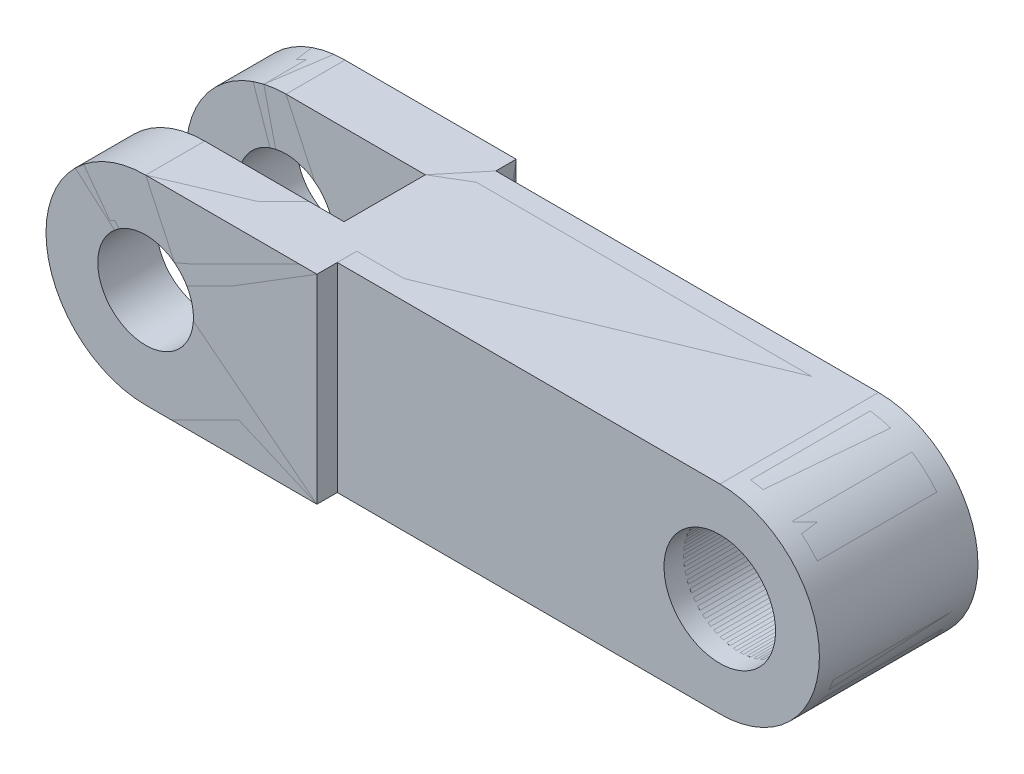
ISO-10303-21;
HEADER;
FILE_DESCRIPTION(('STEP AP214'),'2;1');
FILE_NAME('part.step','',(''),(''),'','','');
FILE_SCHEMA(('AUTOMOTIVE_DESIGN { 1 0 10303 214 1 1 1 1 }'));
ENDSEC;
DATA;
#1=APPLICATION_CONTEXT('core data for automotive mechanical design processes');
#2=APPLICATION_PROTOCOL_DEFINITION('international standard','automotive_design',2000,#1);
#3=PRODUCT_CONTEXT('',#1,'mechanical');
#4=PRODUCT('Part','Part','',(#3));
#5=PRODUCT_RELATED_PRODUCT_CATEGORY('part','',(#4));
#6=PRODUCT_DEFINITION_FORMATION('','',#4);
#7=PRODUCT_DEFINITION_CONTEXT('part definition',#1,'design');
#8=PRODUCT_DEFINITION('design','',#6,#7);
#9=PRODUCT_DEFINITION_SHAPE('','',#8);
#10=(LENGTH_UNIT() NAMED_UNIT(*) SI_UNIT(.MILLI.,.METRE.));
#11=(NAMED_UNIT(*) PLANE_ANGLE_UNIT() SI_UNIT($,.RADIAN.));
#12=(NAMED_UNIT(*) SI_UNIT($,.STERADIAN.) SOLID_ANGLE_UNIT());
#13=UNCERTAINTY_MEASURE_WITH_UNIT(LENGTH_MEASURE(1.E-05),#10,'distance_accuracy_value','');
#14=(GEOMETRIC_REPRESENTATION_CONTEXT(3) GLOBAL_UNCERTAINTY_ASSIGNED_CONTEXT((#13)) GLOBAL_UNIT_ASSIGNED_CONTEXT((#10,
#11,#12)) REPRESENTATION_CONTEXT('',''));
#15=CARTESIAN_POINT('',(0.,0.,0.));
#16=DIRECTION('',(0.,0.,1.));
#17=DIRECTION('',(1.,0.,0.));
#18=AXIS2_PLACEMENT_3D('',#15,#16,#17);
#19=CARTESIAN_POINT('',(-5.5,-0.094581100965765,-2.55));
#20=DIRECTION('',(0.,0.,-1.));
#21=DIRECTION('',(0.,1.,0.));
#22=AXIS2_PLACEMENT_3D('',#19,#20,#21);
#23=CYLINDRICAL_SURFACE('',#22,7.);
#24=CARTESIAN_POINT('',(-5.5,-0.0945811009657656,-20.));
#25=DIRECTION('',(0.,0.,1.));
#26=DIRECTION('',(1.,0.,0.));
#27=AXIS2_PLACEMENT_3D('',#24,#25,#26);
#28=CIRCLE('',#27,7.);
#29=CARTESIAN_POINT('',(1.5,-0.0945811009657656,-20.));
#30=VERTEX_POINT('',#29);
#31=EDGE_CURVE('P0_E468',#30,#30,#28,.T.);
#32=ORIENTED_EDGE('',*,*,#31,.F.);
#33=EDGE_LOOP('',(#32));
#34=FACE_BOUND('',#33,.T.);
#35=CARTESIAN_POINT('',(-5.5,-0.0945811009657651,-5.));
#36=DIRECTION('',(0.,0.,1.));
#37=DIRECTION('',(1.,0.,0.));
#38=AXIS2_PLACEMENT_3D('',#35,#36,#37);
#39=CIRCLE('',#38,7.);
#40=CARTESIAN_POINT('',(1.5,-0.0945811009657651,-5.));
#41=VERTEX_POINT('',#40);
#42=EDGE_CURVE('P0_E479',#41,#41,#39,.T.);
#43=ORIENTED_EDGE('',*,*,#42,.T.);
#44=EDGE_LOOP('',(#43));
#45=FACE_BOUND('',#44,.T.);
#46=ADVANCED_FACE('P0_F348',(#34,#45),#23,.F.);
#47=CARTESIAN_POINT('',(-5.5,-0.094581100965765,-22.45));
#48=DIRECTION('',(0.,0.,1.));
#49=DIRECTION('',(0.,-1.,0.));
#50=AXIS2_PLACEMENT_3D('',#47,#48,#49);
#51=CYLINDRICAL_SURFACE('',#50,12.5000000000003);
#52=DIRECTION('',(0.,0.,1.));
#53=VECTOR('',#52,1.);
#54=CARTESIAN_POINT('',(-5.5170109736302,-12.594569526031,-34.750032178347));
#55=LINE('',#54,#53);
#56=CARTESIAN_POINT('',(-5.5170109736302,-12.594569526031,-20.));
#57=VERTEX_POINT('',#56);
#58=CARTESIAN_POINT('',(-5.51701097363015,-12.594569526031,-5.));
#59=VERTEX_POINT('',#58);
#60=EDGE_CURVE('P0_E454',#57,#59,#55,.T.);
#61=ORIENTED_EDGE('',*,*,#60,.F.);
#62=CARTESIAN_POINT('',(-5.5,-0.0945811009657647,-20.));
#63=DIRECTION('',(0.,0.,1.));
#64=DIRECTION('',(1.,0.,0.));
#65=AXIS2_PLACEMENT_3D('',#62,#63,#64);
#66=CIRCLE('',#65,12.5000000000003);
#67=CARTESIAN_POINT('',(-5.48298902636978,12.4054073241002,-20.));
#68=VERTEX_POINT('',#67);
#69=EDGE_CURVE('P0_E362',#57,#68,#66,.T.);
#70=ORIENTED_EDGE('',*,*,#69,.T.);
#71=DIRECTION('',(0.,0.,-1.));
#72=VECTOR('',#71,1.);
#73=CARTESIAN_POINT('',(-5.4829890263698,12.4054073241,-34.750032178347));
#74=LINE('',#73,#72);
#75=CARTESIAN_POINT('',(-5.48298902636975,12.4054073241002,-5.));
#76=VERTEX_POINT('',#75);
#77=EDGE_CURVE('P0_E535',#76,#68,#74,.T.);
#78=ORIENTED_EDGE('',*,*,#77,.F.);
#79=CARTESIAN_POINT('',(-5.5,-0.0945811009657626,-5.));
#80=DIRECTION('',(0.,0.,1.));
#81=DIRECTION('',(1.,0.,0.));
#82=AXIS2_PLACEMENT_3D('',#79,#80,#81);
#83=CIRCLE('',#82,12.5000000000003);
#84=EDGE_CURVE('P0_E474',#59,#76,#83,.T.);
#85=ORIENTED_EDGE('',*,*,#84,.F.);
#86=EDGE_LOOP('',(#61,#70,#78,#85));
#87=FACE_BOUND('',#86,.T.);
#88=ADVANCED_FACE('P0_F593',(#87),#51,.T.);
#89=CARTESIAN_POINT('',(-75.,0.,-17.6));
#90=DIRECTION('',(0.,0.,-1.));
#91=DIRECTION('',(-1.,0.,0.));
#92=AXIS2_PLACEMENT_3D('',#89,#90,#91);
#93=CYLINDRICAL_SURFACE('',#92,5.99999999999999);
#94=CARTESIAN_POINT('',(-75.,0.,-17.6));
#95=DIRECTION('',(0.,0.,-1.));
#96=DIRECTION('',(-1.,0.,0.));
#97=AXIS2_PLACEMENT_3D('',#94,#95,#96);
#98=CIRCLE('',#97,5.99999999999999);
#99=CARTESIAN_POINT('',(-81.,0.,-17.6));
#100=VERTEX_POINT('',#99);
#101=EDGE_CURVE('P0_E523',#100,#100,#98,.F.);
#102=ORIENTED_EDGE('',*,*,#101,.T.);
#103=EDGE_LOOP('',(#102));
#104=FACE_BOUND('',#103,.T.);
#105=CARTESIAN_POINT('',(-75.,0.,-25.));
#106=DIRECTION('',(0.,0.,-1.));
#107=DIRECTION('',(-1.,0.,0.));
#108=AXIS2_PLACEMENT_3D('',#105,#106,#107);
#109=CIRCLE('',#108,5.99999999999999);
#110=CARTESIAN_POINT('',(-81.,0.,-25.));
#111=VERTEX_POINT('',#110);
#112=EDGE_CURVE('P0_E508',#111,#111,#109,.F.);
#113=ORIENTED_EDGE('',*,*,#112,.F.);
#114=EDGE_LOOP('',(#113));
#115=FACE_BOUND('',#114,.T.);
#116=ADVANCED_FACE('P0_F634',(#104,#115),#93,.F.);
#117=CARTESIAN_POINT('',(-57.5,12.47619618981,-17.6));
#118=DIRECTION('',(1.,0.,0.));
#119=DIRECTION('',(0.,0.,1.));
#120=AXIS2_PLACEMENT_3D('',#117,#118,#119);
#121=PLANE('',#120);
#122=DIRECTION('',(0.,1.,0.));
#123=VECTOR('',#122,1.);
#124=CARTESIAN_POINT('',(-57.5,2.47617303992,-7.4));
#125=LINE('',#124,#123);
#126=CARTESIAN_POINT('',(-57.4999999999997,-12.5238269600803,-7.39999999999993));
#127=VERTEX_POINT('',#126);
#128=CARTESIAN_POINT('',(-57.5000000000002,12.4761961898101,-7.39999999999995));
#129=VERTEX_POINT('',#128);
#130=EDGE_CURVE('P0_E507',#127,#129,#125,.T.);
#131=ORIENTED_EDGE('',*,*,#130,.T.);
#132=DIRECTION('',(0.,0.,1.));
#133=VECTOR('',#132,1.);
#134=CARTESIAN_POINT('',(-57.5000000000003,12.47619618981,-34.750032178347));
#135=LINE('',#134,#133);
#136=CARTESIAN_POINT('',(-57.5000000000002,12.4761961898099,-17.5999999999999));
#137=VERTEX_POINT('',#136);
#138=EDGE_CURVE('P0_E541',#137,#129,#135,.T.);
#139=ORIENTED_EDGE('',*,*,#138,.F.);
#140=DIRECTION('',(0.,-1.,0.));
#141=VECTOR('',#140,1.);
#142=CARTESIAN_POINT('',(-57.5,-2.35,-17.6));
#143=LINE('',#142,#141);
#144=CARTESIAN_POINT('',(-57.4999999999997,-12.5238269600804,-17.5999999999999));
#145=VERTEX_POINT('',#144);
#146=EDGE_CURVE('P0_E416',#137,#145,#143,.T.);
#147=ORIENTED_EDGE('',*,*,#146,.T.);
#148=DIRECTION('',(0.,0.,-1.));
#149=VECTOR('',#148,1.);
#150=CARTESIAN_POINT('',(-57.4999999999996,-12.5238269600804,-34.750032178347));
#151=LINE('',#150,#149);
#152=EDGE_CURVE('P0_E519',#127,#145,#151,.T.);
#153=ORIENTED_EDGE('',*,*,#152,.F.);
#154=EDGE_LOOP('',(#131,#139,#147,#153));
#155=FACE_BOUND('',#154,.T.);
#156=ADVANCED_FACE('P0_F608',(#155),#121,.F.);
#157=CARTESIAN_POINT('',(-87.8,12.8,-17.6));
#158=DIRECTION('',(0.,0.,-1.));
#159=DIRECTION('',(1.,0.,0.));
#160=AXIS2_PLACEMENT_3D('',#157,#158,#159);
#161=PLANE('',#160);
#162=ORIENTED_EDGE('',*,*,#101,.F.);
#163=EDGE_LOOP('',(#162));
#164=FACE_BOUND('',#163,.T.);
#165=CARTESIAN_POINT('',(-75.,0.,-17.6));
#166=DIRECTION('',(0.,0.,1.));
#167=DIRECTION('',(1.,0.,0.));
#168=AXIS2_PLACEMENT_3D('',#165,#166,#167);
#169=CIRCLE('',#168,12.5000000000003);
#170=CARTESIAN_POINT('',(-74.9829890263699,12.499988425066,-17.5999999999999));
#171=VERTEX_POINT('',#170);
#172=CARTESIAN_POINT('',(-75.0170109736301,-12.499988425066,-17.5999999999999));
#173=VERTEX_POINT('',#172);
#174=EDGE_CURVE('P0_E409',#171,#173,#169,.T.);
#175=ORIENTED_EDGE('',*,*,#174,.T.);
#176=DIRECTION('',(-0.999999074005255,0.00136087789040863,0.));
#177=VECTOR('',#176,1.);
#178=CARTESIAN_POINT('',(-40.2670109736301,-12.5472789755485,-17.5999999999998));
#179=LINE('',#178,#177);
#180=EDGE_CURVE('P0_E516',#145,#173,#179,.T.);
#181=ORIENTED_EDGE('',*,*,#180,.F.);
#182=ORIENTED_EDGE('',*,*,#146,.F.);
#183=DIRECTION('',(0.999999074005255,-0.00136087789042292,0.));
#184=VECTOR('',#183,1.);
#185=CARTESIAN_POINT('',(-40.2329890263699,12.452697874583,-17.5999999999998));
#186=LINE('',#185,#184);
#187=EDGE_CURVE('P0_E546',#171,#137,#186,.T.);
#188=ORIENTED_EDGE('',*,*,#187,.F.);
#189=EDGE_LOOP('',(#175,#181,#182,#188));
#190=FACE_BOUND('',#189,.T.);
#191=ADVANCED_FACE('P0_F609',(#164,#190),#161,.F.);
#192=CARTESIAN_POINT('',(-75.,0.,-25.));
#193=DIRECTION('',(0.,0.,1.));
#194=DIRECTION('',(1.,0.,0.));
#195=AXIS2_PLACEMENT_3D('',#192,#193,#194);
#196=CYLINDRICAL_SURFACE('',#195,12.5000000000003);
#197=ORIENTED_EDGE('',*,*,#174,.F.);
#198=DIRECTION('',(0.,0.,1.));
#199=VECTOR('',#198,1.);
#200=CARTESIAN_POINT('',(-74.98298902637,12.499988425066,-34.750032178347));
#201=LINE('',#200,#199);
#202=CARTESIAN_POINT('',(-74.9829890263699,12.499988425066,-24.9999999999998));
#203=VERTEX_POINT('',#202);
#204=EDGE_CURVE('P0_E551',#203,#171,#201,.T.);
#205=ORIENTED_EDGE('',*,*,#204,.F.);
#206=CARTESIAN_POINT('',(-75.,0.,-25.));
#207=DIRECTION('',(0.,0.,1.));
#208=DIRECTION('',(1.,0.,0.));
#209=AXIS2_PLACEMENT_3D('',#206,#207,#208);
#210=CIRCLE('',#209,12.5000000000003);
#211=CARTESIAN_POINT('',(-75.0170109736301,-12.499988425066,-24.9999999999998));
#212=VERTEX_POINT('',#211);
#213=EDGE_CURVE('P0_E581',#212,#203,#210,.F.);
#214=ORIENTED_EDGE('',*,*,#213,.F.);
#215=DIRECTION('',(0.,0.,-1.));
#216=VECTOR('',#215,1.);
#217=CARTESIAN_POINT('',(-75.01701097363,-12.499988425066,-34.750032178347));
#218=LINE('',#217,#216);
#219=EDGE_CURVE('P0_E512',#173,#212,#218,.T.);
#220=ORIENTED_EDGE('',*,*,#219,.F.);
#221=EDGE_LOOP('',(#197,#205,#214,#220));
#222=FACE_BOUND('',#221,.T.);
#223=ADVANCED_FACE('P0_F613',(#222),#196,.T.);
#224=CARTESIAN_POINT('',(-87.84,12.84,-25.));
#225=DIRECTION('',(0.,0.,-1.));
#226=DIRECTION('',(1.,0.,0.));
#227=AXIS2_PLACEMENT_3D('',#224,#225,#226);
#228=PLANE('',#227);
#229=ORIENTED_EDGE('',*,*,#112,.T.);
#230=EDGE_LOOP('',(#229));
#231=FACE_BOUND('',#230,.T.);
#232=ORIENTED_EDGE('',*,*,#213,.T.);
#233=DIRECTION('',(-0.999999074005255,0.00136087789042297,0.));
#234=VECTOR('',#233,1.);
#235=CARTESIAN_POINT('',(-40.2329890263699,12.452697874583,-24.9999999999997));
#236=LINE('',#235,#234);
#237=CARTESIAN_POINT('',(-53.5000000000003,12.4707526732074,-24.9999999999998));
#238=VERTEX_POINT('',#237);
#239=EDGE_CURVE('P0_E556',#238,#203,#236,.T.);
#240=ORIENTED_EDGE('',*,*,#239,.F.);
#241=DIRECTION('',(0.,-1.,0.));
#242=VECTOR('',#241,1.);
#243=CARTESIAN_POINT('',(-53.5,-0.0292589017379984,-25.));
#244=LINE('',#243,#242);
#245=CARTESIAN_POINT('',(-53.4999999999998,-12.5292704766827,-24.9999999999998));
#246=VERTEX_POINT('',#245);
#247=EDGE_CURVE('P0_E505',#238,#246,#244,.T.);
#248=ORIENTED_EDGE('',*,*,#247,.T.);
#249=DIRECTION('',(0.999999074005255,-0.0013608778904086,0.));
#250=VECTOR('',#249,1.);
#251=CARTESIAN_POINT('',(-40.2670109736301,-12.5472789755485,-24.9999999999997));
#252=LINE('',#251,#250);
#253=EDGE_CURVE('P0_E451',#212,#246,#252,.T.);
#254=ORIENTED_EDGE('',*,*,#253,.F.);
#255=EDGE_LOOP('',(#232,#240,#248,#254));
#256=FACE_BOUND('',#255,.T.);
#257=ADVANCED_FACE('P0_F615',(#231,#256),#228,.T.);
#258=CARTESIAN_POINT('',(-53.5,-12.529270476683,-25.));
#259=DIRECTION('',(-1.,0.,0.));
#260=DIRECTION('',(0.,0.,1.));
#261=AXIS2_PLACEMENT_3D('',#258,#259,#260);
#262=PLANE('',#261);
#263=ORIENTED_EDGE('',*,*,#247,.F.);
#264=DIRECTION('',(0.,0.,-1.));
#265=VECTOR('',#264,1.);
#266=CARTESIAN_POINT('',(-53.5000000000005,12.4707526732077,-34.750032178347));
#267=LINE('',#266,#265);
#268=CARTESIAN_POINT('',(-53.5000000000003,12.4707526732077,-20.));
#269=VERTEX_POINT('',#268);
#270=EDGE_CURVE('P0_E462',#269,#238,#267,.T.);
#271=ORIENTED_EDGE('',*,*,#270,.F.);
#272=DIRECTION('',(0.,1.,0.));
#273=VECTOR('',#272,1.);
#274=CARTESIAN_POINT('',(-53.5000000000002,34.620109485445,-20.));
#275=LINE('',#274,#273);
#276=CARTESIAN_POINT('',(-53.5000000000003,-12.5292704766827,-20.));
#277=VERTEX_POINT('',#276);
#278=EDGE_CURVE('P0_E458',#277,#269,#275,.T.);
#279=ORIENTED_EDGE('',*,*,#278,.F.);
#280=DIRECTION('',(0.,0.,1.));
#281=VECTOR('',#280,1.);
#282=CARTESIAN_POINT('',(-53.4999999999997,-12.5292704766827,-34.750032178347));
#283=LINE('',#282,#281);
#284=EDGE_CURVE('P0_E446',#246,#277,#283,.T.);
#285=ORIENTED_EDGE('',*,*,#284,.F.);
#286=EDGE_LOOP('',(#263,#271,#279,#285));
#287=FACE_BOUND('',#286,.T.);
#288=ADVANCED_FACE('P0_F460',(#287),#262,.F.);
#289=CARTESIAN_POINT('',(-87.8,-12.52382696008,-7.4));
#290=DIRECTION('',(0.,0.,1.));
#291=DIRECTION('',(1.,0.,0.));
#292=AXIS2_PLACEMENT_3D('',#289,#290,#291);
#293=PLANE('',#292);
#294=CARTESIAN_POINT('',(-75.,0.,-7.4));
#295=DIRECTION('',(0.,0.,-1.));
#296=DIRECTION('',(-1.,0.,0.));
#297=AXIS2_PLACEMENT_3D('',#294,#295,#296);
#298=CIRCLE('',#297,5.99999999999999);
#299=CARTESIAN_POINT('',(-81.,0.,-7.4));
#300=VERTEX_POINT('',#299);
#301=EDGE_CURVE('P0_E499',#300,#300,#298,.T.);
#302=ORIENTED_EDGE('',*,*,#301,.F.);
#303=EDGE_LOOP('',(#302));
#304=FACE_BOUND('',#303,.T.);
#305=DIRECTION('',(0.999999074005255,-0.0013608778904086,0.));
#306=VECTOR('',#305,1.);
#307=CARTESIAN_POINT('',(-40.2670109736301,-12.5472789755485,-7.39999999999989));
#308=LINE('',#307,#306);
#309=CARTESIAN_POINT('',(-75.0170109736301,-12.499988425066,-7.39999999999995));
#310=VERTEX_POINT('',#309);
#311=EDGE_CURVE('P0_E485',#310,#127,#308,.T.);
#312=ORIENTED_EDGE('',*,*,#311,.F.);
#313=CARTESIAN_POINT('',(-75.,0.,-7.4));
#314=DIRECTION('',(0.,0.,1.));
#315=DIRECTION('',(0.,-1.,0.));
#316=AXIS2_PLACEMENT_3D('',#313,#314,#315);
#317=CIRCLE('',#316,12.5000000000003);
#318=CARTESIAN_POINT('',(-74.9829890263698,12.499988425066,-7.39999999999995));
#319=VERTEX_POINT('',#318);
#320=EDGE_CURVE('P0_E497',#310,#319,#317,.F.);
#321=ORIENTED_EDGE('',*,*,#320,.T.);
#322=DIRECTION('',(-0.999999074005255,0.00136087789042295,0.));
#323=VECTOR('',#322,1.);
#324=CARTESIAN_POINT('',(-40.2329890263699,12.452697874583,-7.39999999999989));
#325=LINE('',#324,#323);
#326=EDGE_CURVE('P0_E538',#129,#319,#325,.T.);
#327=ORIENTED_EDGE('',*,*,#326,.F.);
#328=ORIENTED_EDGE('',*,*,#130,.F.);
#329=EDGE_LOOP('',(#312,#321,#327,#328));
#330=FACE_BOUND('',#329,.T.);
#331=ADVANCED_FACE('P0_F607',(#304,#330),#293,.F.);
#332=CARTESIAN_POINT('',(-5.4829890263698,12.4054073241,0.));
#333=DIRECTION('',(0.00136087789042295,0.999999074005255,0.));
#334=DIRECTION('',(0.,0.,-1.));
#335=AXIS2_PLACEMENT_3D('',#332,#333,#334);
#336=PLANE('',#335);
#337=DIRECTION('',(0.999999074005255,-0.00136087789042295,0.));
#338=VECTOR('',#337,1.);
#339=CARTESIAN_POINT('',(-5.4829890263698,12.4054073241,-20.));
#340=LINE('',#339,#338);
#341=EDGE_CURVE('P0_E464',#269,#68,#340,.T.);
#342=ORIENTED_EDGE('',*,*,#341,.F.);
#343=ORIENTED_EDGE('',*,*,#270,.T.);
#344=ORIENTED_EDGE('',*,*,#239,.T.);
#345=ORIENTED_EDGE('',*,*,#204,.T.);
#346=ORIENTED_EDGE('',*,*,#187,.T.);
#347=ORIENTED_EDGE('',*,*,#138,.T.);
#348=ORIENTED_EDGE('',*,*,#326,.T.);
#349=DIRECTION('',(0.,0.,1.));
#350=VECTOR('',#349,1.);
#351=CARTESIAN_POINT('',(-74.9829890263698,12.499988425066,-3.7));
#352=LINE('',#351,#350);
#353=CARTESIAN_POINT('',(-74.9829890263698,12.4999884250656,0.));
#354=VERTEX_POINT('',#353);
#355=EDGE_CURVE('P0_E486',#319,#354,#352,.T.);
#356=ORIENTED_EDGE('',*,*,#355,.T.);
#357=DIRECTION('',(-0.999999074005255,0.00136087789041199,0.));
#358=VECTOR('',#357,1.);
#359=CARTESIAN_POINT('',(-53.5,12.4707526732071,0.));
#360=LINE('',#359,#358);
#361=CARTESIAN_POINT('',(-53.5,12.4707526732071,0.));
#362=VERTEX_POINT('',#361);
#363=EDGE_CURVE('P0_E573',#362,#354,#360,.T.);
#364=ORIENTED_EDGE('',*,*,#363,.F.);
#365=DIRECTION('',(0.,0.,-1.));
#366=VECTOR('',#365,1.);
#367=CARTESIAN_POINT('',(-53.5,12.470752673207,-12.500011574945));
#368=LINE('',#367,#366);
#369=CARTESIAN_POINT('',(-53.5,12.4707526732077,-5.));
#370=VERTEX_POINT('',#369);
#371=EDGE_CURVE('P0_E493',#362,#370,#368,.T.);
#372=ORIENTED_EDGE('',*,*,#371,.T.);
#373=DIRECTION('',(0.999999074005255,-0.00136087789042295,0.));
#374=VECTOR('',#373,1.);
#375=CARTESIAN_POINT('',(-5.4829890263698,12.4054073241,-5.));
#376=LINE('',#375,#374);
#377=EDGE_CURVE('P0_E476',#370,#76,#376,.T.);
#378=ORIENTED_EDGE('',*,*,#377,.T.);
#379=ORIENTED_EDGE('',*,*,#77,.T.);
#380=EDGE_LOOP('',(#342,#343,#344,#345,#346,#347,#348,#356,#364,#372,#378,#379));
#381=FACE_BOUND('',#380,.T.);
#382=ADVANCED_FACE('P0_F595',(#381),#336,.T.);
#383=CARTESIAN_POINT('',(-75.,0.,-7.4));
#384=DIRECTION('',(0.,0.,1.));
#385=DIRECTION('',(0.,-1.,0.));
#386=AXIS2_PLACEMENT_3D('',#383,#384,#385);
#387=CYLINDRICAL_SURFACE('',#386,12.5000000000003);
#388=ORIENTED_EDGE('',*,*,#355,.F.);
#389=ORIENTED_EDGE('',*,*,#320,.F.);
#390=DIRECTION('',(0.,0.,-1.));
#391=VECTOR('',#390,1.);
#392=CARTESIAN_POINT('',(-75.01701097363,-12.499988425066,-34.750032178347));
#393=LINE('',#392,#391);
#394=CARTESIAN_POINT('',(-75.0170109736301,-12.499988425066,0.));
#395=VERTEX_POINT('',#394);
#396=EDGE_CURVE('P0_E482',#395,#310,#393,.T.);
#397=ORIENTED_EDGE('',*,*,#396,.F.);
#398=CARTESIAN_POINT('',(-75.,0.,0.));
#399=DIRECTION('',(0.,0.,1.));
#400=DIRECTION('',(0.,-1.,0.));
#401=AXIS2_PLACEMENT_3D('',#398,#399,#400);
#402=CIRCLE('',#401,12.5000000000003);
#403=EDGE_CURVE('P0_E570',#354,#395,#402,.T.);
#404=ORIENTED_EDGE('',*,*,#403,.F.);
#405=EDGE_LOOP('',(#388,#389,#397,#404));
#406=FACE_BOUND('',#405,.T.);
#407=ADVANCED_FACE('P0_F604',(#406),#387,.T.);
#408=CARTESIAN_POINT('',(-75.01701097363,-12.499988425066,0.));
#409=DIRECTION('',(-0.0013608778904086,-0.999999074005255,0.));
#410=DIRECTION('',(0.,0.,-1.));
#411=AXIS2_PLACEMENT_3D('',#408,#409,#410);
#412=PLANE('',#411);
#413=ORIENTED_EDGE('',*,*,#284,.T.);
#414=DIRECTION('',(-0.999999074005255,0.0013608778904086,0.));
#415=VECTOR('',#414,1.);
#416=CARTESIAN_POINT('',(-75.01701097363,-12.499988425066,-20.));
#417=LINE('',#416,#415);
#418=EDGE_CURVE('P0_E11',#57,#277,#417,.T.);
#419=ORIENTED_EDGE('',*,*,#418,.F.);
#420=ORIENTED_EDGE('',*,*,#60,.T.);
#421=DIRECTION('',(-0.999999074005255,0.0013608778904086,0.));
#422=VECTOR('',#421,1.);
#423=CARTESIAN_POINT('',(-75.01701097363,-12.499988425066,-5.));
#424=LINE('',#423,#422);
#425=CARTESIAN_POINT('',(-53.5,-12.5292704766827,-5.));
#426=VERTEX_POINT('',#425);
#427=EDGE_CURVE('P0_E356',#59,#426,#424,.T.);
#428=ORIENTED_EDGE('',*,*,#427,.T.);
#429=DIRECTION('',(0.,0.,1.));
#430=VECTOR('',#429,1.);
#431=CARTESIAN_POINT('',(-53.5,-12.529270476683,-12.500011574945));
#432=LINE('',#431,#430);
#433=CARTESIAN_POINT('',(-53.5,-12.529270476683,0.));
#434=VERTEX_POINT('',#433);
#435=EDGE_CURVE('P0_E371',#426,#434,#432,.T.);
#436=ORIENTED_EDGE('',*,*,#435,.T.);
#437=DIRECTION('',(0.999999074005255,-0.00136087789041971,0.));
#438=VECTOR('',#437,1.);
#439=CARTESIAN_POINT('',(-75.0170109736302,-12.499988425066,0.));
#440=LINE('',#439,#438);
#441=EDGE_CURVE('P0_E491',#395,#434,#440,.T.);
#442=ORIENTED_EDGE('',*,*,#441,.F.);
#443=ORIENTED_EDGE('',*,*,#396,.T.);
#444=ORIENTED_EDGE('',*,*,#311,.T.);
#445=ORIENTED_EDGE('',*,*,#152,.T.);
#446=ORIENTED_EDGE('',*,*,#180,.T.);
#447=ORIENTED_EDGE('',*,*,#219,.T.);
#448=ORIENTED_EDGE('',*,*,#253,.T.);
#449=EDGE_LOOP('',(#413,#419,#420,#428,#436,#442,#443,#444,#445,#446,#447,#448));
#450=FACE_BOUND('',#449,.T.);
#451=ADVANCED_FACE('P0_F447',(#450),#412,.T.);
#452=CARTESIAN_POINT('',(-53.5,12.470752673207,0.));
#453=DIRECTION('',(-1.,0.,0.));
#454=DIRECTION('',(0.,0.,-1.));
#455=AXIS2_PLACEMENT_3D('',#452,#453,#454);
#456=PLANE('',#455);
#457=ORIENTED_EDGE('',*,*,#371,.F.);
#458=DIRECTION('',(0.,1.,0.));
#459=VECTOR('',#458,1.);
#460=CARTESIAN_POINT('',(-53.5,4.470729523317,0.));
#461=LINE('',#460,#459);
#462=EDGE_CURVE('P0_E487',#434,#362,#461,.T.);
#463=ORIENTED_EDGE('',*,*,#462,.F.);
#464=ORIENTED_EDGE('',*,*,#435,.F.);
#465=DIRECTION('',(0.,-1.,0.));
#466=VECTOR('',#465,1.);
#467=CARTESIAN_POINT('',(-53.5,28.7284885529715,-5.));
#468=LINE('',#467,#466);
#469=EDGE_CURVE('P0_E471',#370,#426,#468,.T.);
#470=ORIENTED_EDGE('',*,*,#469,.F.);
#471=EDGE_LOOP('',(#457,#463,#464,#470));
#472=FACE_BOUND('',#471,.T.);
#473=ADVANCED_FACE('P0_F598',(#472),#456,.F.);
#474=CARTESIAN_POINT('',(-75.,0.,0.));
#475=DIRECTION('',(0.,0.,-1.));
#476=DIRECTION('',(-1.,0.,0.));
#477=AXIS2_PLACEMENT_3D('',#474,#475,#476);
#478=CYLINDRICAL_SURFACE('',#477,5.99999999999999);
#479=ORIENTED_EDGE('',*,*,#301,.T.);
#480=EDGE_LOOP('',(#479));
#481=FACE_BOUND('',#480,.T.);
#482=CARTESIAN_POINT('',(-75.,0.,0.));
#483=DIRECTION('',(0.,0.,-1.));
#484=DIRECTION('',(-1.,0.,0.));
#485=AXIS2_PLACEMENT_3D('',#482,#483,#484);
#486=CIRCLE('',#485,5.99999999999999);
#487=CARTESIAN_POINT('',(-81.,0.,0.));
#488=VERTEX_POINT('',#487);
#489=EDGE_CURVE('P0_E490',#488,#488,#486,.T.);
#490=ORIENTED_EDGE('',*,*,#489,.F.);
#491=EDGE_LOOP('',(#490));
#492=FACE_BOUND('',#491,.T.);
#493=ADVANCED_FACE('P0_F642',(#481,#492),#478,.F.);
#494=CARTESIAN_POINT('',(-87.84,-12.529270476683,0.));
#495=DIRECTION('',(0.,0.,1.));
#496=DIRECTION('',(1.,0.,0.));
#497=AXIS2_PLACEMENT_3D('',#494,#495,#496);
#498=PLANE('',#497);
#499=ORIENTED_EDGE('',*,*,#489,.T.);
#500=EDGE_LOOP('',(#499));
#501=FACE_BOUND('',#500,.T.);
#502=ORIENTED_EDGE('',*,*,#441,.T.);
#503=ORIENTED_EDGE('',*,*,#462,.T.);
#504=ORIENTED_EDGE('',*,*,#363,.T.);
#505=ORIENTED_EDGE('',*,*,#403,.T.);
#506=EDGE_LOOP('',(#502,#503,#504,#505));
#507=FACE_BOUND('',#506,.T.);
#508=ADVANCED_FACE('P0_F350',(#501,#507),#498,.T.);
#509=CARTESIAN_POINT('',(-53.5,-27.9013770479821,-5.));
#510=DIRECTION('',(0.,0.,1.));
#511=DIRECTION('',(1.,0.,0.));
#512=AXIS2_PLACEMENT_3D('',#509,#510,#511);
#513=PLANE('',#512);
#514=ORIENTED_EDGE('',*,*,#42,.F.);
#515=EDGE_LOOP('',(#514));
#516=FACE_BOUND('',#515,.T.);
#517=ORIENTED_EDGE('',*,*,#469,.T.);
#518=ORIENTED_EDGE('',*,*,#427,.F.);
#519=ORIENTED_EDGE('',*,*,#84,.T.);
#520=ORIENTED_EDGE('',*,*,#377,.F.);
#521=EDGE_LOOP('',(#517,#518,#519,#520));
#522=FACE_BOUND('',#521,.T.);
#523=ADVANCED_FACE('P0_F588',(#516,#522),#513,.T.);
#524=CARTESIAN_POINT('',(-53.5000000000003,-33.9495957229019,-20.));
#525=DIRECTION('',(0.,0.,1.));
#526=DIRECTION('',(1.,0.,0.));
#527=AXIS2_PLACEMENT_3D('',#524,#525,#526);
#528=PLANE('',#527);
#529=ORIENTED_EDGE('',*,*,#31,.T.);
#530=EDGE_LOOP('',(#529));
#531=FACE_BOUND('',#530,.T.);
#532=ORIENTED_EDGE('',*,*,#341,.T.);
#533=ORIENTED_EDGE('',*,*,#69,.F.);
#534=ORIENTED_EDGE('',*,*,#418,.T.);
#535=ORIENTED_EDGE('',*,*,#278,.T.);
#536=EDGE_LOOP('',(#532,#533,#534,#535));
#537=FACE_BOUND('',#536,.T.);
#538=ADVANCED_FACE('P0_F457',(#531,#537),#528,.F.);
#539=CLOSED_SHELL('',(#46,#88,#116,#156,#191,#223,#257,#288,#331,#382,#407,#451,#473,#493,#508,
#523,#538));
#540=MANIFOLD_SOLID_BREP('P0_B2',#539);
#541=CARTESIAN_POINT('',(-75.,0.,-17.6));
#542=DIRECTION('',(0.,0.,-1.));
#543=DIRECTION('',(-1.,0.,0.));
#544=AXIS2_PLACEMENT_3D('',#541,#542,#543);
#545=CYLINDRICAL_SURFACE('',#544,5.99999999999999);
#546=CARTESIAN_POINT('',(-75.,0.,-17.6));
#547=DIRECTION('',(0.,0.,-1.));
#548=DIRECTION('',(-1.,0.,0.));
#549=AXIS2_PLACEMENT_3D('',#546,#547,#548);
#550=CIRCLE('',#549,5.99999999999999);
#551=CARTESIAN_POINT('',(-81.,0.,-17.6));
#552=VERTEX_POINT('',#551);
#553=EDGE_CURVE('P1_E19',#552,#552,#550,.F.);
#554=ORIENTED_EDGE('',*,*,#553,.T.);
#555=EDGE_LOOP('',(#554));
#556=FACE_BOUND('',#555,.T.);
#557=CARTESIAN_POINT('',(-75.,0.,-25.));
#558=DIRECTION('',(0.,0.,-1.));
#559=DIRECTION('',(-1.,0.,0.));
#560=AXIS2_PLACEMENT_3D('',#557,#558,#559);
#561=CIRCLE('',#560,5.99999999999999);
#562=CARTESIAN_POINT('',(-81.,0.,-25.));
#563=VERTEX_POINT('',#562);
#564=EDGE_CURVE('P1_E210',#563,#563,#561,.F.);
#565=ORIENTED_EDGE('',*,*,#564,.F.);
#566=EDGE_LOOP('',(#565));
#567=FACE_BOUND('',#566,.T.);
#568=ADVANCED_FACE('P1_F15',(#556,#567),#545,.F.);
#569=CARTESIAN_POINT('',(-5.5,-0.094581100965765,-2.55));
#570=DIRECTION('',(0.,0.,-1.));
#571=DIRECTION('',(0.,1.,0.));
#572=AXIS2_PLACEMENT_3D('',#569,#570,#571);
#573=CYLINDRICAL_SURFACE('',#572,7.);
#574=CARTESIAN_POINT('',(-5.5,-0.0945811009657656,-22.45));
#575=DIRECTION('',(0.,0.,-1.));
#576=DIRECTION('',(0.,1.,0.));
#577=AXIS2_PLACEMENT_3D('',#574,#575,#576);
#578=CIRCLE('',#577,7.);
#579=CARTESIAN_POINT('',(-5.5,6.90541889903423,-22.45));
#580=VERTEX_POINT('',#579);
#581=EDGE_CURVE('P1_E206',#580,#580,#578,.T.);
#582=ORIENTED_EDGE('',*,*,#581,.T.);
#583=EDGE_LOOP('',(#582));
#584=FACE_BOUND('',#583,.T.);
#585=CARTESIAN_POINT('',(-5.5,-0.094581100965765,-2.55));
#586=DIRECTION('',(0.,0.,-1.));
#587=DIRECTION('',(0.,1.,0.));
#588=AXIS2_PLACEMENT_3D('',#585,#586,#587);
#589=CIRCLE('',#588,7.);
#590=CARTESIAN_POINT('',(-5.5,6.90541889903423,-2.55));
#591=VERTEX_POINT('',#590);
#592=EDGE_CURVE('P1_E148',#591,#591,#589,.F.);
#593=ORIENTED_EDGE('',*,*,#592,.T.);
#594=EDGE_LOOP('',(#593));
#595=FACE_BOUND('',#594,.T.);
#596=ADVANCED_FACE('P1_F280',(#584,#595),#573,.F.);
#597=CARTESIAN_POINT('',(-57.5,12.47619618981,-17.6));
#598=DIRECTION('',(1.,0.,0.));
#599=DIRECTION('',(0.,0.,1.));
#600=AXIS2_PLACEMENT_3D('',#597,#598,#599);
#601=PLANE('',#600);
#602=DIRECTION('',(0.,1.,0.));
#603=VECTOR('',#602,1.);
#604=CARTESIAN_POINT('',(-57.5,2.47617303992,-7.4));
#605=LINE('',#604,#603);
#606=CARTESIAN_POINT('',(-57.4999999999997,-12.5238269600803,-7.39999999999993));
#607=VERTEX_POINT('',#606);
#608=CARTESIAN_POINT('',(-57.5000000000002,12.4761961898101,-7.39999999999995));
#609=VERTEX_POINT('',#608);
#610=EDGE_CURVE('P1_E98',#607,#609,#605,.T.);
#611=ORIENTED_EDGE('',*,*,#610,.T.);
#612=DIRECTION('',(0.,0.,1.));
#613=VECTOR('',#612,1.);
#614=CARTESIAN_POINT('',(-57.5000000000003,12.47619618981,-34.750032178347));
#615=LINE('',#614,#613);
#616=CARTESIAN_POINT('',(-57.5000000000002,12.4761961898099,-17.5999999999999));
#617=VERTEX_POINT('',#616);
#618=EDGE_CURVE('P1_E155',#617,#609,#615,.T.);
#619=ORIENTED_EDGE('',*,*,#618,.F.);
#620=DIRECTION('',(0.,-1.,0.));
#621=VECTOR('',#620,1.);
#622=CARTESIAN_POINT('',(-57.5,-2.35,-17.6));
#623=LINE('',#622,#621);
#624=CARTESIAN_POINT('',(-57.4999999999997,-12.5238269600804,-17.5999999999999));
#625=VERTEX_POINT('',#624);
#626=EDGE_CURVE('P1_E91',#617,#625,#623,.T.);
#627=ORIENTED_EDGE('',*,*,#626,.T.);
#628=DIRECTION('',(0.,0.,-1.));
#629=VECTOR('',#628,1.);
#630=CARTESIAN_POINT('',(-57.4999999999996,-12.5238269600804,-34.750032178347));
#631=LINE('',#630,#629);
#632=EDGE_CURVE('P1_E129',#607,#625,#631,.T.);
#633=ORIENTED_EDGE('',*,*,#632,.F.);
#634=EDGE_LOOP('',(#611,#619,#627,#633));
#635=FACE_BOUND('',#634,.T.);
#636=ADVANCED_FACE('P1_F278',(#635),#601,.F.);
#637=CARTESIAN_POINT('',(-87.8,12.8,-17.6));
#638=DIRECTION('',(0.,0.,-1.));
#639=DIRECTION('',(1.,0.,0.));
#640=AXIS2_PLACEMENT_3D('',#637,#638,#639);
#641=PLANE('',#640);
#642=ORIENTED_EDGE('',*,*,#553,.F.);
#643=EDGE_LOOP('',(#642));
#644=FACE_BOUND('',#643,.T.);
#645=CARTESIAN_POINT('',(-75.,0.,-17.6));
#646=DIRECTION('',(0.,0.,1.));
#647=DIRECTION('',(1.,0.,0.));
#648=AXIS2_PLACEMENT_3D('',#645,#646,#647);
#649=CIRCLE('',#648,12.5000000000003);
#650=CARTESIAN_POINT('',(-74.9829890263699,12.499988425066,-17.5999999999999));
#651=VERTEX_POINT('',#650);
#652=CARTESIAN_POINT('',(-75.0170109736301,-12.499988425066,-17.5999999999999));
#653=VERTEX_POINT('',#652);
#654=EDGE_CURVE('P1_E85',#651,#653,#649,.T.);
#655=ORIENTED_EDGE('',*,*,#654,.T.);
#656=DIRECTION('',(-0.999999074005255,0.00136087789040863,0.));
#657=VECTOR('',#656,1.);
#658=CARTESIAN_POINT('',(-40.2670109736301,-12.5472789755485,-17.5999999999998));
#659=LINE('',#658,#657);
#660=EDGE_CURVE('P1_E114',#625,#653,#659,.T.);
#661=ORIENTED_EDGE('',*,*,#660,.F.);
#662=ORIENTED_EDGE('',*,*,#626,.F.);
#663=DIRECTION('',(0.999999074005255,-0.00136087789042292,0.));
#664=VECTOR('',#663,1.);
#665=CARTESIAN_POINT('',(-40.2329890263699,12.452697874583,-17.5999999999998));
#666=LINE('',#665,#664);
#667=EDGE_CURVE('P1_E117',#651,#617,#666,.T.);
#668=ORIENTED_EDGE('',*,*,#667,.F.);
#669=EDGE_LOOP('',(#655,#661,#662,#668));
#670=FACE_BOUND('',#669,.T.);
#671=ADVANCED_FACE('P1_F112',(#644,#670),#641,.F.);
#672=CARTESIAN_POINT('',(-75.,0.,-25.));
#673=DIRECTION('',(0.,0.,1.));
#674=DIRECTION('',(1.,0.,0.));
#675=AXIS2_PLACEMENT_3D('',#672,#673,#674);
#676=CYLINDRICAL_SURFACE('',#675,12.5000000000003);
#677=ORIENTED_EDGE('',*,*,#654,.F.);
#678=DIRECTION('',(0.,0.,1.));
#679=VECTOR('',#678,1.);
#680=CARTESIAN_POINT('',(-74.98298902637,12.499988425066,-34.750032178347));
#681=LINE('',#680,#679);
#682=CARTESIAN_POINT('',(-74.9829890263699,12.499988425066,-24.9999999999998));
#683=VERTEX_POINT('',#682);
#684=EDGE_CURVE('P1_E163',#683,#651,#681,.T.);
#685=ORIENTED_EDGE('',*,*,#684,.F.);
#686=CARTESIAN_POINT('',(-75.,0.,-25.));
#687=DIRECTION('',(0.,0.,1.));
#688=DIRECTION('',(1.,0.,0.));
#689=AXIS2_PLACEMENT_3D('',#686,#687,#688);
#690=CIRCLE('',#689,12.5000000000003);
#691=CARTESIAN_POINT('',(-75.0170109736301,-12.499988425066,-24.9999999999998));
#692=VERTEX_POINT('',#691);
#693=EDGE_CURVE('P1_E119',#692,#683,#690,.F.);
#694=ORIENTED_EDGE('',*,*,#693,.F.);
#695=DIRECTION('',(0.,0.,-1.));
#696=VECTOR('',#695,1.);
#697=CARTESIAN_POINT('',(-75.01701097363,-12.499988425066,-34.750032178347));
#698=LINE('',#697,#696);
#699=EDGE_CURVE('P1_E121',#653,#692,#698,.T.);
#700=ORIENTED_EDGE('',*,*,#699,.F.);
#701=EDGE_LOOP('',(#677,#685,#694,#700));
#702=FACE_BOUND('',#701,.T.);
#703=ADVANCED_FACE('P1_F122',(#702),#676,.T.);
#704=CARTESIAN_POINT('',(-87.84,12.84,-25.));
#705=DIRECTION('',(0.,0.,-1.));
#706=DIRECTION('',(1.,0.,0.));
#707=AXIS2_PLACEMENT_3D('',#704,#705,#706);
#708=PLANE('',#707);
#709=ORIENTED_EDGE('',*,*,#564,.T.);
#710=EDGE_LOOP('',(#709));
#711=FACE_BOUND('',#710,.T.);
#712=ORIENTED_EDGE('',*,*,#693,.T.);
#713=DIRECTION('',(-0.999999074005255,0.00136087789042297,0.));
#714=VECTOR('',#713,1.);
#715=CARTESIAN_POINT('',(-40.2329890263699,12.452697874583,-24.9999999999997));
#716=LINE('',#715,#714);
#717=CARTESIAN_POINT('',(-53.5000000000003,12.4707526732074,-24.9999999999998));
#718=VERTEX_POINT('',#717);
#719=EDGE_CURVE('P1_E167',#718,#683,#716,.T.);
#720=ORIENTED_EDGE('',*,*,#719,.F.);
#721=DIRECTION('',(0.,-1.,0.));
#722=VECTOR('',#721,1.);
#723=CARTESIAN_POINT('',(-53.5,-0.0292589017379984,-25.));
#724=LINE('',#723,#722);
#725=CARTESIAN_POINT('',(-53.4999999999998,-12.5292704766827,-24.9999999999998));
#726=VERTEX_POINT('',#725);
#727=EDGE_CURVE('P1_E213',#718,#726,#724,.T.);
#728=ORIENTED_EDGE('',*,*,#727,.T.);
#729=DIRECTION('',(0.999999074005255,-0.0013608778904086,0.));
#730=VECTOR('',#729,1.);
#731=CARTESIAN_POINT('',(-40.2670109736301,-12.5472789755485,-24.9999999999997));
#732=LINE('',#731,#730);
#733=EDGE_CURVE('P1_E125',#692,#726,#732,.T.);
#734=ORIENTED_EDGE('',*,*,#733,.F.);
#735=EDGE_LOOP('',(#712,#720,#728,#734));
#736=FACE_BOUND('',#735,.T.);
#737=ADVANCED_FACE('P1_F216',(#711,#736),#708,.T.);
#738=CARTESIAN_POINT('',(-53.5,-12.529270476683,-25.));
#739=DIRECTION('',(-1.,0.,0.));
#740=DIRECTION('',(0.,0.,1.));
#741=AXIS2_PLACEMENT_3D('',#738,#739,#740);
#742=PLANE('',#741);
#743=ORIENTED_EDGE('',*,*,#727,.F.);
#744=DIRECTION('',(0.,0.,-1.));
#745=VECTOR('',#744,1.);
#746=CARTESIAN_POINT('',(-53.5000000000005,12.4707526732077,-34.750032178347));
#747=LINE('',#746,#745);
#748=CARTESIAN_POINT('',(-53.5000000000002,12.4707526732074,-22.4499999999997));
#749=VERTEX_POINT('',#748);
#750=EDGE_CURVE('P1_E170',#749,#718,#747,.T.);
#751=ORIENTED_EDGE('',*,*,#750,.F.);
#752=DIRECTION('',(0.,-1.,0.));
#753=VECTOR('',#752,1.);
#754=CARTESIAN_POINT('',(-53.5,-17.779247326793,-22.45));
#755=LINE('',#754,#753);
#756=CARTESIAN_POINT('',(-53.4999999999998,-12.5292704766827,-22.4499999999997));
#757=VERTEX_POINT('',#756);
#758=EDGE_CURVE('P1_E209',#749,#757,#755,.T.);
#759=ORIENTED_EDGE('',*,*,#758,.T.);
#760=DIRECTION('',(0.,0.,1.));
#761=VECTOR('',#760,1.);
#762=CARTESIAN_POINT('',(-53.4999999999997,-12.5292704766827,-34.750032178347));
#763=LINE('',#762,#761);
#764=EDGE_CURVE('P1_E226',#726,#757,#763,.T.);
#765=ORIENTED_EDGE('',*,*,#764,.F.);
#766=EDGE_LOOP('',(#743,#751,#759,#765));
#767=FACE_BOUND('',#766,.T.);
#768=ADVANCED_FACE('P1_F222',(#767),#742,.F.);
#769=CARTESIAN_POINT('',(7.605,12.470752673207,-22.45));
#770=DIRECTION('',(0.,0.,1.));
#771=DIRECTION('',(-1.,0.,0.));
#772=AXIS2_PLACEMENT_3D('',#769,#770,#771);
#773=PLANE('',#772);
#774=ORIENTED_EDGE('',*,*,#581,.F.);
#775=EDGE_LOOP('',(#774));
#776=FACE_BOUND('',#775,.T.);
#777=CARTESIAN_POINT('',(-5.5,-0.094581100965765,-22.45));
#778=DIRECTION('',(0.,0.,1.));
#779=DIRECTION('',(0.,-1.,0.));
#780=AXIS2_PLACEMENT_3D('',#777,#778,#779);
#781=CIRCLE('',#780,12.5000000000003);
#782=CARTESIAN_POINT('',(-5.48298902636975,12.4054073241,-22.4499999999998));
#783=VERTEX_POINT('',#782);
#784=CARTESIAN_POINT('',(-5.51701097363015,-12.594569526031,-22.4499999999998));
#785=VERTEX_POINT('',#784);
#786=EDGE_CURVE('P1_E204',#783,#785,#781,.F.);
#787=ORIENTED_EDGE('',*,*,#786,.T.);
#788=DIRECTION('',(0.999999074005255,-0.0013608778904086,0.));
#789=VECTOR('',#788,1.);
#790=CARTESIAN_POINT('',(-40.2670109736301,-12.5472789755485,-22.4499999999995));
#791=LINE('',#790,#789);
#792=EDGE_CURVE('P1_E236',#757,#785,#791,.T.);
#793=ORIENTED_EDGE('',*,*,#792,.F.);
#794=ORIENTED_EDGE('',*,*,#758,.F.);
#795=DIRECTION('',(-0.999999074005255,0.00136087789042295,0.));
#796=VECTOR('',#795,1.);
#797=CARTESIAN_POINT('',(-40.2329890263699,12.452697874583,-22.4499999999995));
#798=LINE('',#797,#796);
#799=EDGE_CURVE('P1_E175',#783,#749,#798,.T.);
#800=ORIENTED_EDGE('',*,*,#799,.F.);
#801=EDGE_LOOP('',(#787,#793,#794,#800));
#802=FACE_BOUND('',#801,.T.);
#803=ADVANCED_FACE('P1_F312',(#776,#802),#773,.F.);
#804=CARTESIAN_POINT('',(-5.5,-0.094581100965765,-22.45));
#805=DIRECTION('',(0.,0.,1.));
#806=DIRECTION('',(0.,-1.,0.));
#807=AXIS2_PLACEMENT_3D('',#804,#805,#806);
#808=CYLINDRICAL_SURFACE('',#807,12.5000000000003);
#809=ORIENTED_EDGE('',*,*,#786,.F.);
#810=DIRECTION('',(0.,0.,-1.));
#811=VECTOR('',#810,1.);
#812=CARTESIAN_POINT('',(-5.4829890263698,12.4054073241,-34.750032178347));
#813=LINE('',#812,#811);
#814=CARTESIAN_POINT('',(-5.48298902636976,12.4054073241,-2.55));
#815=VERTEX_POINT('',#814);
#816=EDGE_CURVE('P1_E180',#815,#783,#813,.T.);
#817=ORIENTED_EDGE('',*,*,#816,.F.);
#818=CARTESIAN_POINT('',(-5.5,-0.0945811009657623,-2.55));
#819=DIRECTION('',(0.,0.,1.));
#820=DIRECTION('',(0.,-1.,0.));
#821=AXIS2_PLACEMENT_3D('',#818,#819,#820);
#822=CIRCLE('',#821,12.5000000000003);
#823=CARTESIAN_POINT('',(-5.51701097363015,-12.594569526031,-2.55000000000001));
#824=VERTEX_POINT('',#823);
#825=EDGE_CURVE('P1_E202',#815,#824,#822,.F.);
#826=ORIENTED_EDGE('',*,*,#825,.T.);
#827=DIRECTION('',(0.,0.,1.));
#828=VECTOR('',#827,1.);
#829=CARTESIAN_POINT('',(-5.5170109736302,-12.594569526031,-34.750032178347));
#830=LINE('',#829,#828);
#831=EDGE_CURVE('P1_E238',#785,#824,#830,.T.);
#832=ORIENTED_EDGE('',*,*,#831,.F.);
#833=EDGE_LOOP('',(#809,#817,#826,#832));
#834=FACE_BOUND('',#833,.T.);
#835=ADVANCED_FACE('P1_F309',(#834),#808,.T.);
#836=CARTESIAN_POINT('',(7.605,-13.199581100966,-2.55));
#837=DIRECTION('',(0.,0.,-1.));
#838=DIRECTION('',(-1.,0.,0.));
#839=AXIS2_PLACEMENT_3D('',#836,#837,#838);
#840=PLANE('',#839);
#841=ORIENTED_EDGE('',*,*,#592,.F.);
#842=EDGE_LOOP('',(#841));
#843=FACE_BOUND('',#842,.T.);
#844=DIRECTION('',(-0.999999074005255,0.0013608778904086,0.));
#845=VECTOR('',#844,1.);
#846=CARTESIAN_POINT('',(-40.2670109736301,-12.5472789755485,-2.55000000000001));
#847=LINE('',#846,#845);
#848=CARTESIAN_POINT('',(-53.5,-12.5292704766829,-2.55000000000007));
#849=VERTEX_POINT('',#848);
#850=EDGE_CURVE('P1_E247',#824,#849,#847,.T.);
#851=ORIENTED_EDGE('',*,*,#850,.F.);
#852=ORIENTED_EDGE('',*,*,#825,.F.);
#853=DIRECTION('',(0.999999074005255,-0.00136087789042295,0.));
#854=VECTOR('',#853,1.);
#855=CARTESIAN_POINT('',(-40.2329890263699,12.452697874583,-2.55000000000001));
#856=LINE('',#855,#854);
#857=CARTESIAN_POINT('',(-53.5,12.4707526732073,-2.55000000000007));
#858=VERTEX_POINT('',#857);
#859=EDGE_CURVE('P1_E147',#858,#815,#856,.T.);
#860=ORIENTED_EDGE('',*,*,#859,.F.);
#861=DIRECTION('',(0.,-1.,0.));
#862=VECTOR('',#861,1.);
#863=CARTESIAN_POINT('',(-53.5,-0.0292589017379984,-2.55000000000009));
#864=LINE('',#863,#862);
#865=EDGE_CURVE('P1_E197',#858,#849,#864,.T.);
#866=ORIENTED_EDGE('',*,*,#865,.T.);
#867=EDGE_LOOP('',(#851,#852,#860,#866));
#868=FACE_BOUND('',#867,.T.);
#869=ADVANCED_FACE('P1_F306',(#843,#868),#840,.F.);
#870=CARTESIAN_POINT('',(-87.8,-12.52382696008,-7.4));
#871=DIRECTION('',(0.,0.,1.));
#872=DIRECTION('',(1.,0.,0.));
#873=AXIS2_PLACEMENT_3D('',#870,#871,#872);
#874=PLANE('',#873);
#875=CARTESIAN_POINT('',(-75.,0.,-7.4));
#876=DIRECTION('',(0.,0.,-1.));
#877=DIRECTION('',(-1.,0.,0.));
#878=AXIS2_PLACEMENT_3D('',#875,#876,#877);
#879=CIRCLE('',#878,5.99999999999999);
#880=CARTESIAN_POINT('',(-81.,0.,-7.4));
#881=VERTEX_POINT('',#880);
#882=EDGE_CURVE('P1_E194',#881,#881,#879,.T.);
#883=ORIENTED_EDGE('',*,*,#882,.F.);
#884=EDGE_LOOP('',(#883));
#885=FACE_BOUND('',#884,.T.);
#886=DIRECTION('',(0.999999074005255,-0.0013608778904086,0.));
#887=VECTOR('',#886,1.);
#888=CARTESIAN_POINT('',(-40.2670109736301,-12.5472789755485,-7.39999999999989));
#889=LINE('',#888,#887);
#890=CARTESIAN_POINT('',(-75.0170109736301,-12.499988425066,-7.39999999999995));
#891=VERTEX_POINT('',#890);
#892=EDGE_CURVE('P1_E131',#891,#607,#889,.T.);
#893=ORIENTED_EDGE('',*,*,#892,.F.);
#894=CARTESIAN_POINT('',(-75.,0.,-7.4));
#895=DIRECTION('',(0.,0.,1.));
#896=DIRECTION('',(0.,-1.,0.));
#897=AXIS2_PLACEMENT_3D('',#894,#895,#896);
#898=CIRCLE('',#897,12.5000000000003);
#899=CARTESIAN_POINT('',(-74.9829890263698,12.499988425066,-7.39999999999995));
#900=VERTEX_POINT('',#899);
#901=EDGE_CURVE('P1_E154',#891,#900,#898,.F.);
#902=ORIENTED_EDGE('',*,*,#901,.T.);
#903=DIRECTION('',(-0.999999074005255,0.00136087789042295,0.));
#904=VECTOR('',#903,1.);
#905=CARTESIAN_POINT('',(-40.2329890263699,12.452697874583,-7.39999999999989));
#906=LINE('',#905,#904);
#907=EDGE_CURVE('P1_E151',#609,#900,#906,.T.);
#908=ORIENTED_EDGE('',*,*,#907,.F.);
#909=ORIENTED_EDGE('',*,*,#610,.F.);
#910=EDGE_LOOP('',(#893,#902,#908,#909));
#911=FACE_BOUND('',#910,.T.);
#912=ADVANCED_FACE('P1_F277',(#885,#911),#874,.F.);
#913=CARTESIAN_POINT('',(-5.4829890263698,12.4054073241,0.));
#914=DIRECTION('',(0.00136087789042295,0.999999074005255,0.));
#915=DIRECTION('',(0.,0.,-1.));
#916=AXIS2_PLACEMENT_3D('',#913,#914,#915);
#917=PLANE('',#916);
#918=ORIENTED_EDGE('',*,*,#907,.T.);
#919=DIRECTION('',(0.,0.,1.));
#920=VECTOR('',#919,1.);
#921=CARTESIAN_POINT('',(-74.9829890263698,12.499988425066,-3.7));
#922=LINE('',#921,#920);
#923=CARTESIAN_POINT('',(-74.9829890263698,12.4999884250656,0.));
#924=VERTEX_POINT('',#923);
#925=EDGE_CURVE('P1_E199',#900,#924,#922,.T.);
#926=ORIENTED_EDGE('',*,*,#925,.T.);
#927=DIRECTION('',(-0.999999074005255,0.00136087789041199,0.));
#928=VECTOR('',#927,1.);
#929=CARTESIAN_POINT('',(-53.5,12.4707526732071,0.));
#930=LINE('',#929,#928);
#931=CARTESIAN_POINT('',(-53.5,12.4707526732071,0.));
#932=VERTEX_POINT('',#931);
#933=EDGE_CURVE('P1_E191',#932,#924,#930,.T.);
#934=ORIENTED_EDGE('',*,*,#933,.F.);
#935=DIRECTION('',(0.,0.,-1.));
#936=VECTOR('',#935,1.);
#937=CARTESIAN_POINT('',(-53.5,12.470752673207,-12.500011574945));
#938=LINE('',#937,#936);
#939=EDGE_CURVE('P1_E255',#932,#858,#938,.T.);
#940=ORIENTED_EDGE('',*,*,#939,.T.);
#941=ORIENTED_EDGE('',*,*,#859,.T.);
#942=ORIENTED_EDGE('',*,*,#816,.T.);
#943=ORIENTED_EDGE('',*,*,#799,.T.);
#944=ORIENTED_EDGE('',*,*,#750,.T.);
#945=ORIENTED_EDGE('',*,*,#719,.T.);
#946=ORIENTED_EDGE('',*,*,#684,.T.);
#947=ORIENTED_EDGE('',*,*,#667,.T.);
#948=ORIENTED_EDGE('',*,*,#618,.T.);
#949=EDGE_LOOP('',(#918,#926,#934,#940,#941,#942,#943,#944,#945,#946,#947,#948));
#950=FACE_BOUND('',#949,.T.);
#951=ADVANCED_FACE('P1_F218',(#950),#917,.T.);
#952=CARTESIAN_POINT('',(-75.,0.,-7.4));
#953=DIRECTION('',(0.,0.,1.));
#954=DIRECTION('',(0.,-1.,0.));
#955=AXIS2_PLACEMENT_3D('',#952,#953,#954);
#956=CYLINDRICAL_SURFACE('',#955,12.5000000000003);
#957=ORIENTED_EDGE('',*,*,#925,.F.);
#958=ORIENTED_EDGE('',*,*,#901,.F.);
#959=DIRECTION('',(0.,0.,-1.));
#960=VECTOR('',#959,1.);
#961=CARTESIAN_POINT('',(-75.01701097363,-12.499988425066,-34.750032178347));
#962=LINE('',#961,#960);
#963=CARTESIAN_POINT('',(-75.0170109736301,-12.499988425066,0.));
#964=VERTEX_POINT('',#963);
#965=EDGE_CURVE('P1_E143',#964,#891,#962,.T.);
#966=ORIENTED_EDGE('',*,*,#965,.F.);
#967=CARTESIAN_POINT('',(-75.,0.,0.));
#968=DIRECTION('',(0.,0.,1.));
#969=DIRECTION('',(0.,-1.,0.));
#970=AXIS2_PLACEMENT_3D('',#967,#968,#969);
#971=CIRCLE('',#970,12.5000000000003);
#972=EDGE_CURVE('P1_E188',#924,#964,#971,.T.);
#973=ORIENTED_EDGE('',*,*,#972,.F.);
#974=EDGE_LOOP('',(#957,#958,#966,#973));
#975=FACE_BOUND('',#974,.T.);
#976=ADVANCED_FACE('P1_F275',(#975),#956,.T.);
#977=CARTESIAN_POINT('',(-75.01701097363,-12.499988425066,0.));
#978=DIRECTION('',(-0.0013608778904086,-0.999999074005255,0.));
#979=DIRECTION('',(0.,0.,-1.));
#980=AXIS2_PLACEMENT_3D('',#977,#978,#979);
#981=PLANE('',#980);
#982=ORIENTED_EDGE('',*,*,#850,.T.);
#983=DIRECTION('',(0.,0.,1.));
#984=VECTOR('',#983,1.);
#985=CARTESIAN_POINT('',(-53.5,-12.529270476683,-12.500011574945));
#986=LINE('',#985,#984);
#987=CARTESIAN_POINT('',(-53.5,-12.529270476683,0.));
#988=VERTEX_POINT('',#987);
#989=EDGE_CURVE('P1_E34',#849,#988,#986,.T.);
#990=ORIENTED_EDGE('',*,*,#989,.T.);
#991=DIRECTION('',(0.999999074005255,-0.00136087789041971,0.));
#992=VECTOR('',#991,1.);
#993=CARTESIAN_POINT('',(-75.0170109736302,-12.499988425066,0.));
#994=LINE('',#993,#992);
#995=EDGE_CURVE('P1_E185',#964,#988,#994,.T.);
#996=ORIENTED_EDGE('',*,*,#995,.F.);
#997=ORIENTED_EDGE('',*,*,#965,.T.);
#998=ORIENTED_EDGE('',*,*,#892,.T.);
#999=ORIENTED_EDGE('',*,*,#632,.T.);
#1000=ORIENTED_EDGE('',*,*,#660,.T.);
#1001=ORIENTED_EDGE('',*,*,#699,.T.);
#1002=ORIENTED_EDGE('',*,*,#733,.T.);
#1003=ORIENTED_EDGE('',*,*,#764,.T.);
#1004=ORIENTED_EDGE('',*,*,#792,.T.);
#1005=ORIENTED_EDGE('',*,*,#831,.T.);
#1006=EDGE_LOOP('',(#982,#990,#996,#997,#998,#999,#1000,#1001,#1002,#1003,#1004,#1005));
#1007=FACE_BOUND('',#1006,.T.);
#1008=ADVANCED_FACE('P1_F127',(#1007),#981,.T.);
#1009=CARTESIAN_POINT('',(-53.5,12.470752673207,0.));
#1010=DIRECTION('',(-1.,0.,0.));
#1011=DIRECTION('',(0.,0.,-1.));
#1012=AXIS2_PLACEMENT_3D('',#1009,#1010,#1011);
#1013=PLANE('',#1012);
#1014=ORIENTED_EDGE('',*,*,#939,.F.);
#1015=DIRECTION('',(0.,1.,0.));
#1016=VECTOR('',#1015,1.);
#1017=CARTESIAN_POINT('',(-53.5,4.470729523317,0.));
#1018=LINE('',#1017,#1016);
#1019=EDGE_CURVE('P1_E25',#988,#932,#1018,.T.);
#1020=ORIENTED_EDGE('',*,*,#1019,.F.);
#1021=ORIENTED_EDGE('',*,*,#989,.F.);
#1022=ORIENTED_EDGE('',*,*,#865,.F.);
#1023=EDGE_LOOP('',(#1014,#1020,#1021,#1022));
#1024=FACE_BOUND('',#1023,.T.);
#1025=ADVANCED_FACE('P1_F296',(#1024),#1013,.F.);
#1026=CARTESIAN_POINT('',(-75.,0.,0.));
#1027=DIRECTION('',(0.,0.,-1.));
#1028=DIRECTION('',(-1.,0.,0.));
#1029=AXIS2_PLACEMENT_3D('',#1026,#1027,#1028);
#1030=CYLINDRICAL_SURFACE('',#1029,5.99999999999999);
#1031=ORIENTED_EDGE('',*,*,#882,.T.);
#1032=EDGE_LOOP('',(#1031));
#1033=FACE_BOUND('',#1032,.T.);
#1034=CARTESIAN_POINT('',(-75.,0.,0.));
#1035=DIRECTION('',(0.,0.,-1.));
#1036=DIRECTION('',(-1.,0.,0.));
#1037=AXIS2_PLACEMENT_3D('',#1034,#1035,#1036);
#1038=CIRCLE('',#1037,5.99999999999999);
#1039=CARTESIAN_POINT('',(-81.,0.,0.));
#1040=VERTEX_POINT('',#1039);
#1041=EDGE_CURVE('P1_E10',#1040,#1040,#1038,.T.);
#1042=ORIENTED_EDGE('',*,*,#1041,.F.);
#1043=EDGE_LOOP('',(#1042));
#1044=FACE_BOUND('',#1043,.T.);
#1045=ADVANCED_FACE('P1_F292',(#1033,#1044),#1030,.F.);
#1046=CARTESIAN_POINT('',(-87.84,-12.529270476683,0.));
#1047=DIRECTION('',(0.,0.,1.));
#1048=DIRECTION('',(1.,0.,0.));
#1049=AXIS2_PLACEMENT_3D('',#1046,#1047,#1048);
#1050=PLANE('',#1049);
#1051=ORIENTED_EDGE('',*,*,#1041,.T.);
#1052=EDGE_LOOP('',(#1051));
#1053=FACE_BOUND('',#1052,.T.);
#1054=ORIENTED_EDGE('',*,*,#995,.T.);
#1055=ORIENTED_EDGE('',*,*,#1019,.T.);
#1056=ORIENTED_EDGE('',*,*,#933,.T.);
#1057=ORIENTED_EDGE('',*,*,#972,.T.);
#1058=EDGE_LOOP('',(#1054,#1055,#1056,#1057));
#1059=FACE_BOUND('',#1058,.T.);
#1060=ADVANCED_FACE('P1_F17',(#1053,#1059),#1050,.T.);
#1061=CLOSED_SHELL('',(#568,#596,#636,#671,#703,#737,#768,#803,#835,#869,#912,#951,#976,#1008,
#1025,#1045,#1060));
#1062=MANIFOLD_SOLID_BREP('P1_B1',#1061);
#1063=ADVANCED_BREP_SHAPE_REPRESENTATION('',(#18,#540,#1062),#14);
#1064=SHAPE_DEFINITION_REPRESENTATION(#9,#1063);
ENDSEC;
END-ISO-10303-21;
